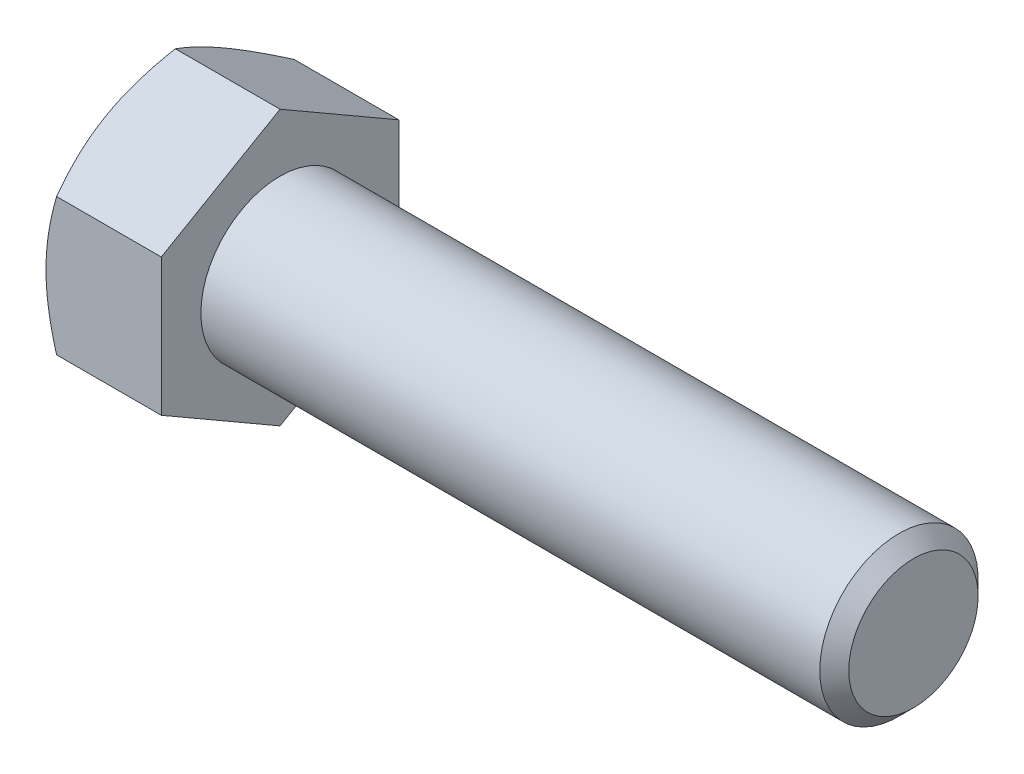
from build123d import *

# Parameters (mm, degrees)
BASEHEAD_DEPTH = 9.2456


with BuildPart() as part:
    # Sketch1 → BaseHead (new body)
    with BuildSketch(Plane(origin=(0, 0, 0), x_dir=(0, 0, -1), z_dir=(1, 0, 0))):
        Polygon((9.525, 5.499261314), (9.525, -5.499261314), (0, -10.998522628), (-9.525, -5.499261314), (-9.525, 5.499261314), (0, 10.998522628), align=None)
    extrude(amount=BASEHEAD_DEPTH)

    # BodySke → BaseBody (revolve)
    with BuildSketch(Plane.XY, mode=Mode.PRIVATE) as basebody_sk:
        Polygon((0, 0), (60.0456, 0), (60.0456, 5.18668), (58.88228, 6.35), (0, 6.35), align=None)
    revolve(basebody_sk.sketch.rotate(Axis((0, 0, 0), (1, 0, 0)), 90), axis=Axis((0, 0, 0), (1, 0, 0)))

    # Sketch3 → HeadChamfer (revolve, cut)
    with BuildSketch(Plane.XY):
        Polygon((0, 9.525), (4.516912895, 17.348522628), (4.516912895, 23.698522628), (-12.7, 23.698522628), (-12.7, 9.525), align=None)
    revolve(axis=Axis((0, 0, 0), (1, 0, 0)), mode=Mode.SUBTRACT)


solid = part.part
